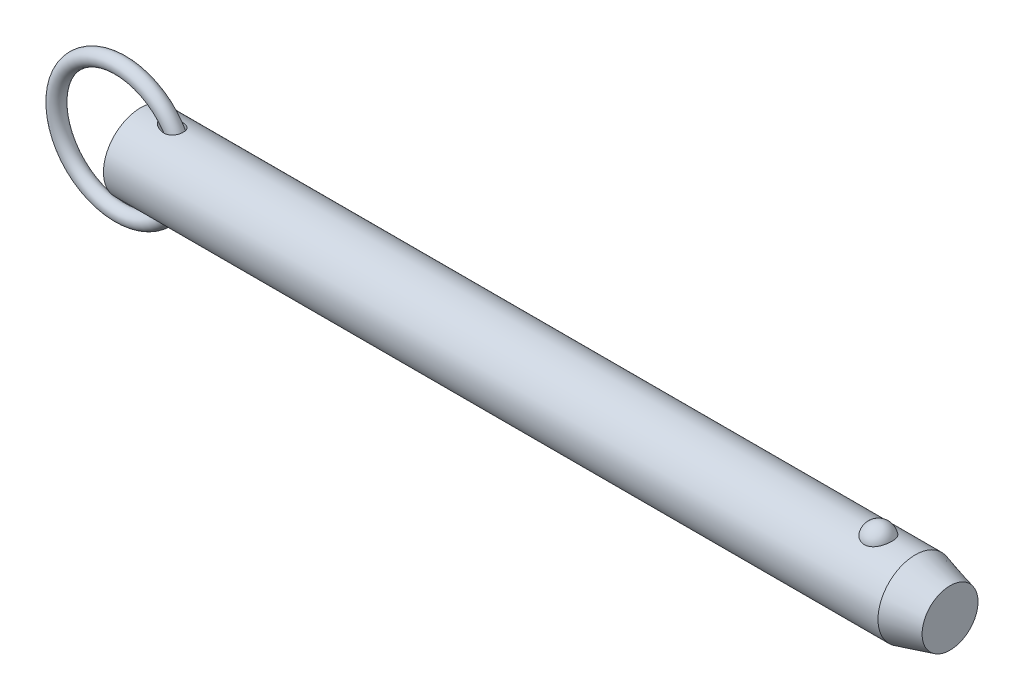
ISO-10303-21;
HEADER;
FILE_DESCRIPTION(('STEP AP214'),'2;1');
FILE_NAME('part.step','',(''),(''),'','','');
FILE_SCHEMA(('AUTOMOTIVE_DESIGN { 1 0 10303 214 1 1 1 1 }'));
ENDSEC;
DATA;
#1=APPLICATION_CONTEXT('core data for automotive mechanical design processes');
#2=APPLICATION_PROTOCOL_DEFINITION('international standard','automotive_design',2000,#1);
#3=PRODUCT_CONTEXT('',#1,'mechanical');
#4=PRODUCT('Part','Part','',(#3));
#5=PRODUCT_RELATED_PRODUCT_CATEGORY('part','',(#4));
#6=PRODUCT_DEFINITION_FORMATION('','',#4);
#7=PRODUCT_DEFINITION_CONTEXT('part definition',#1,'design');
#8=PRODUCT_DEFINITION('design','',#6,#7);
#9=PRODUCT_DEFINITION_SHAPE('','',#8);
#10=(LENGTH_UNIT() NAMED_UNIT(*) SI_UNIT(.MILLI.,.METRE.));
#11=(NAMED_UNIT(*) PLANE_ANGLE_UNIT() SI_UNIT($,.RADIAN.));
#12=(NAMED_UNIT(*) SI_UNIT($,.STERADIAN.) SOLID_ANGLE_UNIT());
#13=UNCERTAINTY_MEASURE_WITH_UNIT(LENGTH_MEASURE(1.E-05),#10,'distance_accuracy_value','');
#14=(GEOMETRIC_REPRESENTATION_CONTEXT(3) GLOBAL_UNCERTAINTY_ASSIGNED_CONTEXT((#13)) GLOBAL_UNIT_ASSIGNED_CONTEXT((#10,
#11,#12)) REPRESENTATION_CONTEXT('',''));
#15=CARTESIAN_POINT('',(0.,0.,0.));
#16=DIRECTION('',(0.,0.,1.));
#17=DIRECTION('',(1.,0.,0.));
#18=AXIS2_PLACEMENT_3D('',#15,#16,#17);
#19=CARTESIAN_POINT('',(-6.08699288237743,0.,0.));
#20=DIRECTION('',(0.,0.,1.));
#21=DIRECTION('',(1.,0.,0.));
#22=AXIS2_PLACEMENT_3D('',#19,#20,#21);
#23=TOROIDAL_SURFACE('',#22,19.05,2.223);
#24=CARTESIAN_POINT('',(15.1860071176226,0.,0.));
#25=VERTEX_POINT('',#24);
#26=VERTEX_LOOP('',#25);
#27=FACE_BOUND('',#26,.T.);
#28=ADVANCED_FACE('P0_F12',(#27),#23,.T.);
#29=CLOSED_SHELL('',(#28));
#30=MANIFOLD_SOLID_BREP('P0_B1',#29);
#31=CARTESIAN_POINT('',(0.,0.,0.));
#32=DIRECTION('',(1.,0.,0.));
#33=DIRECTION('',(0.,0.,-1.));
#34=AXIS2_PLACEMENT_3D('',#31,#32,#33);
#35=CYLINDRICAL_SURFACE('',#34,11.115);
#36=CARTESIAN_POINT('',(6.414051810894,11.0227946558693,-1.4287136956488));
#37=CARTESIAN_POINT('',(6.49338916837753,11.0115377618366,-1.51556642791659));
#38=CARTESIAN_POINT('',(6.57765461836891,10.9998263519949,-1.59789397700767));
#39=CARTESIAN_POINT('',(6.75386647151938,10.9760304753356,-1.75391400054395));
#40=CARTESIAN_POINT('',(6.84582247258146,10.9639455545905,-1.82759540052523));
#41=CARTESIAN_POINT('',(7.03627827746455,10.9397989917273,-1.96698954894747));
#42=CARTESIAN_POINT('',(7.13480838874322,10.9277377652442,-2.03266078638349));
#43=CARTESIAN_POINT('',(7.33681032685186,10.9041015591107,-2.1558582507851));
#44=CARTESIAN_POINT('',(7.44028007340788,10.8925263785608,-2.21338786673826));
#45=CARTESIAN_POINT('',(7.64386117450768,10.8710104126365,-2.31666528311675));
#46=CARTESIAN_POINT('',(7.74368989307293,10.8610119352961,-2.36295942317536));
#47=CARTESIAN_POINT('',(7.94637195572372,10.8420168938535,-2.44863486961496));
#48=CARTESIAN_POINT('',(8.04922612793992,10.8330206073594,-2.48801426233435));
#49=CARTESIAN_POINT('',(8.36115573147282,10.807980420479,-2.59542730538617));
#50=CARTESIAN_POINT('',(8.57411849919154,10.7938278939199,-2.65299817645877));
#51=CARTESIAN_POINT('',(9.00825016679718,10.7725818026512,-2.73800108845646));
#52=CARTESIAN_POINT('',(9.22947335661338,10.7655491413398,-2.76517330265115));
#53=CARTESIAN_POINT('',(9.67368141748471,10.7605872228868,-2.78445308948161));
#54=CARTESIAN_POINT('',(9.89666486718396,10.7626512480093,-2.77658653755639));
#55=CARTESIAN_POINT('',(10.2950172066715,10.7754452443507,-2.72644436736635));
#56=CARTESIAN_POINT('',(10.4712789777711,10.7844280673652,-2.69109376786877));
#57=CARTESIAN_POINT('',(10.7292776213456,10.8024982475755,-2.61722365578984));
#58=CARTESIAN_POINT('',(10.8142337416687,10.8092901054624,-2.58911576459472));
#59=CARTESIAN_POINT('',(10.9813218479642,10.8242580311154,-2.52581287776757));
#60=CARTESIAN_POINT('',(11.0634550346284,10.8324335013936,-2.49062094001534));
#61=CARTESIAN_POINT('',(11.2247418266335,10.8500287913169,-2.41281958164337));
#62=CARTESIAN_POINT('',(11.3038694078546,10.8594572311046,-2.37015806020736));
#63=CARTESIAN_POINT('',(11.4576781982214,10.8792243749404,-2.27770403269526));
#64=CARTESIAN_POINT('',(11.5323615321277,10.8895626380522,-2.22791497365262));
#65=CARTESIAN_POINT('',(11.6765388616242,10.9108113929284,-2.12140590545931));
#66=CARTESIAN_POINT('',(11.7460329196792,10.9217218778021,-2.06468597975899));
#67=CARTESIAN_POINT('',(11.8790597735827,10.9437207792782,-1.94471764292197));
#68=CARTESIAN_POINT('',(11.9425932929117,10.9548091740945,-1.88147002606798));
#69=CARTESIAN_POINT('',(12.109388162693,10.9851999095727,-1.69784918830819));
#70=CARTESIAN_POINT('',(12.205655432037,11.0042655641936,-1.57093023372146));
#71=CARTESIAN_POINT('',(12.374151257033,11.0393391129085,-1.3017676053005));
#72=CARTESIAN_POINT('',(12.4463875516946,11.0553479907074,-1.15952888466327));
#73=CARTESIAN_POINT('',(12.5615818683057,11.0816338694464,-0.87197217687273));
#74=CARTESIAN_POINT('',(12.6058896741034,11.0921698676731,-0.727217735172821));
#75=CARTESIAN_POINT('',(12.6699315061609,11.1075802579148,-0.432089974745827));
#76=CARTESIAN_POINT('',(12.6896681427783,11.1124552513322,-0.281717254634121));
#77=CARTESIAN_POINT('',(12.7040225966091,11.1159901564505,0.0188164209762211));
#78=CARTESIAN_POINT('',(12.6988836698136,11.1147102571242,0.168965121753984));
#79=CARTESIAN_POINT('',(12.6641681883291,11.1062126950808,0.466238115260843));
#80=CARTESIAN_POINT('',(12.6345920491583,11.0989951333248,0.613362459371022));
#81=CARTESIAN_POINT('',(12.5517453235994,11.0794095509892,0.900330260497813));
#82=CARTESIAN_POINT('',(12.4984878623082,11.0670443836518,1.0401777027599));
#83=CARTESIAN_POINT('',(12.3696588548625,11.0385082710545,1.308745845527));
#84=CARTESIAN_POINT('',(12.2940887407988,11.0223375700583,1.43746725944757));
#85=CARTESIAN_POINT('',(12.122380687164,10.987872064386,1.68079704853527));
#86=CARTESIAN_POINT('',(12.0261637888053,10.969569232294,1.79534850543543));
#87=CARTESIAN_POINT('',(11.8161707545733,10.932836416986,2.00695695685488));
#88=CARTESIAN_POINT('',(11.7023941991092,10.9144064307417,2.10401353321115));
#89=CARTESIAN_POINT('',(11.4575656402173,10.8788057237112,2.2810532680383));
#90=CARTESIAN_POINT('',(11.3261451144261,10.8616794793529,2.36053412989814));
#91=CARTESIAN_POINT('',(11.0523589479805,10.8308019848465,2.49839044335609));
#92=CARTESIAN_POINT('',(10.9099908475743,10.8170514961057,2.55676113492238));
#93=CARTESIAN_POINT('',(10.6060622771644,10.7929728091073,2.65666105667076));
#94=CARTESIAN_POINT('',(10.4438877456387,10.7830209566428,2.69640163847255));
#95=CARTESIAN_POINT('',(10.1154037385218,10.7687230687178,2.75293129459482));
#96=CARTESIAN_POINT('',(9.94909141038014,10.7643810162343,2.76970406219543));
#97=CARTESIAN_POINT('',(9.54387061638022,10.7604809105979,2.7848723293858));
#98=CARTESIAN_POINT('',(9.30446860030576,10.7637793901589,2.77227753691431));
#99=CARTESIAN_POINT('',(8.94961255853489,10.7757341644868,2.72524141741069));
#100=CARTESIAN_POINT('',(8.83186896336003,10.7808994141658,2.70482239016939));
#101=CARTESIAN_POINT('',(8.59835142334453,10.7932548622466,2.65509992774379));
#102=CARTESIAN_POINT('',(8.48257728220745,10.8004448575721,2.62579738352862));
#103=CARTESIAN_POINT('',(8.2520846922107,10.8166382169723,2.55827624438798));
#104=CARTESIAN_POINT('',(8.1374021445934,10.8256649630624,2.51994155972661));
#105=CARTESIAN_POINT('',(7.91132058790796,10.8451170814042,2.43486475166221));
#106=CARTESIAN_POINT('',(7.79992154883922,10.8555424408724,2.38812270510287));
#107=CARTESIAN_POINT('',(7.58115677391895,10.8774251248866,2.28638483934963));
#108=CARTESIAN_POINT('',(7.47378802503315,10.8888816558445,2.2313953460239));
#109=CARTESIAN_POINT('',(7.26385624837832,10.9124540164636,2.11310265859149));
#110=CARTESIAN_POINT('',(7.16129168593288,10.9245696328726,2.04980214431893));
#111=CARTESIAN_POINT('',(6.91882218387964,10.9543689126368,1.88540538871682));
#112=CARTESIAN_POINT('',(6.78193778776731,10.9721958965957,1.77979827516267));
#113=CARTESIAN_POINT('',(6.52472441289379,11.0070222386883,1.5498969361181));
#114=CARTESIAN_POINT('',(6.40436902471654,11.0240228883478,1.42563320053));
#115=CARTESIAN_POINT('',(6.21838804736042,11.0509658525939,1.19529359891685));
#116=CARTESIAN_POINT('',(6.14691885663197,11.0615430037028,1.09404520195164));
#117=CARTESIAN_POINT('',(6.02043496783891,11.0805004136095,0.881508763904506));
#118=CARTESIAN_POINT('',(5.96539400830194,11.0888841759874,0.770237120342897));
#119=CARTESIAN_POINT('',(5.88475453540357,11.1012553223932,0.560577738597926));
#120=CARTESIAN_POINT('',(5.85559643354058,11.1057686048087,0.463603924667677));
#121=CARTESIAN_POINT('',(5.81381299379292,11.1122523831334,0.26608330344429));
#122=CARTESIAN_POINT('',(5.80117118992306,11.1142254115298,0.165540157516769));
#123=CARTESIAN_POINT('',(5.79363815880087,11.1153999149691,-0.0364747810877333));
#124=CARTESIAN_POINT('',(5.79878799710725,11.1145949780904,-0.137948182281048));
#125=CARTESIAN_POINT('',(5.82639592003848,11.1102987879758,-0.338493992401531));
#126=CARTESIAN_POINT('',(5.84887234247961,11.1068046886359,-0.437563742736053));
#127=CARTESIAN_POINT('',(5.91510741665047,11.0965857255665,-0.649968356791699));
#128=CARTESIAN_POINT('',(5.9622090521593,11.0893566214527,-0.762222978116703));
#129=CARTESIAN_POINT('',(6.07378449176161,11.072471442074,-0.977396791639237));
#130=CARTESIAN_POINT('',(6.13826787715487,11.0628140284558,-1.08031079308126));
#131=CARTESIAN_POINT('',(6.24101077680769,11.0477136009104,-1.2219580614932));
#132=CARTESIAN_POINT('',(6.27403486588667,11.042895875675,-1.26469183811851));
#133=CARTESIAN_POINT('',(6.34238022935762,11.0330152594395,-1.34817011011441));
#134=CARTESIAN_POINT('',(6.37769867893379,11.0279526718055,-1.38891694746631));
#135=CARTESIAN_POINT('',(6.414051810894,11.0227946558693,-1.4287136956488));
#136=B_SPLINE_CURVE_WITH_KNOTS('',3,(#36,#37,#38,#39,#40,#41,#42,#43,#44,#45,#46,#47,#48,#49,
#50,#51,#52,#53,#54,#55,#56,#57,#58,#59,#60,#61,#62,#63,#64,#65,#66,#67,#68,#69,#70,#71,#72,#73,
#74,#75,#76,#77,#78,#79,#80,#81,#82,#83,#84,#85,#86,#87,#88,#89,#90,#91,#92,#93,#94,#95,#96,#97,
#98,#99,#100,#101,#102,#103,#104,#105,#106,#107,#108,#109,#110,#111,#112,#113,#114,#115,#116,
#117,#118,#119,#120,#121,#122,#123,#124,#125,#126,#127,#128,#129,#130,#131,#132,#133,#134,#135),
.UNSPECIFIED.,.T.,.F.,(4,2,2,2,2,2,2,2,2,2,2,2,2,2,2,2,2,2,2,2,2,2,2,2,2,2,2,2,2,2,2,2,2,2,2,2,
2,2,2,2,2,2,2,2,2,2,2,2,2,4),(0.,0.35443329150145,0.709315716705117,1.0659654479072,
1.42246628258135,1.7536715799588,2.08496839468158,2.74582009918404,3.41227815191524,
4.07824412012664,4.61583787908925,4.88478112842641,5.1536085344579,5.42439170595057,
5.69504436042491,5.96569375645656,6.23631025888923,6.71490729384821,7.19335005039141,
7.64641437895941,8.09943057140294,8.54802575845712,8.99661331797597,9.44495256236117,
9.89326303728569,10.3433195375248,10.7933867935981,11.2550086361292,11.7167345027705,
12.2165866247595,12.7167934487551,13.4318876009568,13.7904664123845,14.1490092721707,
14.5124394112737,14.8758662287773,15.239015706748,15.6020483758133,16.1219860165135,
16.6410830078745,17.0130520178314,17.3844231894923,17.6872330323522,17.9897407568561,
18.2929471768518,18.5964749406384,18.9603532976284,19.3244326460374,19.4870338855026,
19.649438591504),.UNSPECIFIED.);
#137=CARTESIAN_POINT('',(6.414051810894,11.0227946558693,-1.4287136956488));
#138=VERTEX_POINT('',#137);
#139=EDGE_CURVE('P1_E40',#138,#138,#136,.T.);
#140=ORIENTED_EDGE('',*,*,#139,.T.);
#141=EDGE_LOOP('',(#140));
#142=FACE_BOUND('',#141,.T.);
#143=CARTESIAN_POINT('',(230.929563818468,0.,0.));
#144=DIRECTION('',(1.,0.,0.));
#145=DIRECTION('',(0.,0.,-1.));
#146=AXIS2_PLACEMENT_3D('',#143,#144,#145);
#147=CIRCLE('',#146,11.115);
#148=CARTESIAN_POINT('',(230.929563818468,0.,-11.115));
#149=VERTEX_POINT('',#148);
#150=EDGE_CURVE('P1_E25',#149,#149,#147,.T.);
#151=ORIENTED_EDGE('',*,*,#150,.F.);
#152=EDGE_LOOP('',(#151));
#153=FACE_BOUND('',#152,.T.);
#154=CARTESIAN_POINT('',(0.,0.,0.));
#155=DIRECTION('',(1.,0.,0.));
#156=DIRECTION('',(0.,0.,-1.));
#157=AXIS2_PLACEMENT_3D('',#154,#155,#156);
#158=CIRCLE('',#157,11.115);
#159=CARTESIAN_POINT('',(0.,0.,-11.115));
#160=VERTEX_POINT('',#159);
#161=EDGE_CURVE('P1_E9',#160,#160,#158,.T.);
#162=ORIENTED_EDGE('',*,*,#161,.T.);
#163=EDGE_LOOP('',(#162));
#164=FACE_BOUND('',#163,.T.);
#165=CARTESIAN_POINT('',(219.931068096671,10.3028087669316,4.17077409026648));
#166=CARTESIAN_POINT('',(219.714775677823,10.3028003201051,4.17078240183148));
#167=CARTESIAN_POINT('',(219.498548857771,10.3098895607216,4.15340593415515));
#168=CARTESIAN_POINT('',(219.072540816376,10.3373834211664,4.08449540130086));
#169=CARTESIAN_POINT('',(218.862757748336,10.3577841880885,4.03297121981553));
#170=CARTESIAN_POINT('',(218.455782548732,10.4095237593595,3.89746513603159));
#171=CARTESIAN_POINT('',(218.258572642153,10.4408466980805,3.81353029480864));
#172=CARTESIAN_POINT('',(217.881338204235,10.5110236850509,3.61560339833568));
#173=CARTESIAN_POINT('',(217.701317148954,10.5498792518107,3.50160528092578));
#174=CARTESIAN_POINT('',(217.357684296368,10.6322884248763,3.24292464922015));
#175=CARTESIAN_POINT('',(217.194686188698,10.6759443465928,3.09746040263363));
#176=CARTESIAN_POINT('',(216.894591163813,10.7625291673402,2.78171925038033));
#177=CARTESIAN_POINT('',(216.757499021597,10.805457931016,2.61143778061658));
#178=CARTESIAN_POINT('',(216.506408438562,10.8881935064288,2.24226695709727));
#179=CARTESIAN_POINT('',(216.393710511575,10.9277761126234,2.0424412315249));
#180=CARTESIAN_POINT('',(216.201777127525,10.997484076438,1.62578254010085));
#181=CARTESIAN_POINT('',(216.122544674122,11.0276085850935,1.40894804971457));
#182=CARTESIAN_POINT('',(215.998303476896,11.0756732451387,0.961250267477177));
#183=CARTESIAN_POINT('',(215.953760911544,11.0934470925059,0.730239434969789));
#184=CARTESIAN_POINT('',(215.901569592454,11.1143331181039,0.26343964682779));
#185=CARTESIAN_POINT('',(215.893920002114,11.1174456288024,0.0276507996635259));
#186=CARTESIAN_POINT('',(215.91561056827,11.1087161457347,-0.44072963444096));
#187=CARTESIAN_POINT('',(215.944762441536,11.0969502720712,-0.673331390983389));
#188=CARTESIAN_POINT('',(216.039143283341,11.0597872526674,-1.12996621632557));
#189=CARTESIAN_POINT('',(216.104372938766,11.0343898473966,-1.3539991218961));
#190=CARTESIAN_POINT('',(216.26969844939,10.972515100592,-1.78750286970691));
#191=CARTESIAN_POINT('',(216.36983863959,10.9360236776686,-1.99695478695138));
#192=CARTESIAN_POINT('',(216.602940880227,10.8557595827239,-2.3952066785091));
#193=CARTESIAN_POINT('',(216.735905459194,10.8119863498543,-2.5840050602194));
#194=CARTESIAN_POINT('',(217.032407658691,10.7216733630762,-2.93635726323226));
#195=CARTESIAN_POINT('',(217.196056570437,10.675123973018,-3.09981510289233));
#196=CARTESIAN_POINT('',(217.549860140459,10.5846571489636,-3.39592247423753));
#197=CARTESIAN_POINT('',(217.740012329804,10.5407394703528,-3.52857487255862));
#198=CARTESIAN_POINT('',(218.13750141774,10.4616690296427,-3.75646057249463));
#199=CARTESIAN_POINT('',(218.34436705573,10.4263443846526,-3.85245432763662));
#200=CARTESIAN_POINT('',(218.772954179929,10.3675574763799,-4.00798747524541));
#201=CARTESIAN_POINT('',(218.994670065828,10.3440907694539,-4.06754052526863));
#202=CARTESIAN_POINT('',(219.434669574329,10.3128282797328,-4.1461431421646));
#203=CARTESIAN_POINT('',(219.652565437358,10.3043040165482,-4.16707833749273));
#204=CARTESIAN_POINT('',(220.08894951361,10.3016771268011,-4.17357158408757));
#205=CARTESIAN_POINT('',(220.307437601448,10.3075716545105,-4.15913661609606));
#206=CARTESIAN_POINT('',(220.731744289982,10.3326686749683,-4.09636961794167));
#207=CARTESIAN_POINT('',(220.937745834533,10.3514555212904,-4.04909574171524));
#208=CARTESIAN_POINT('',(221.338576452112,10.3998183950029,-3.92320197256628));
#209=CARTESIAN_POINT('',(221.5334046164,10.4293952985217,-3.84457953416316));
#210=CARTESIAN_POINT('',(221.911191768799,10.4969600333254,-3.65612410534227));
#211=CARTESIAN_POINT('',(222.093797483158,10.5351178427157,-3.54564545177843));
#212=CARTESIAN_POINT('',(222.438204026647,10.6154999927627,-3.29718036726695));
#213=CARTESIAN_POINT('',(222.600000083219,10.657725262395,-3.15918764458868));
#214=CARTESIAN_POINT('',(222.906959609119,10.744212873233,-2.8516358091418));
#215=CARTESIAN_POINT('',(223.050891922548,10.7884718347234,-2.68084605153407));
#216=CARTESIAN_POINT('',(223.309237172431,10.872374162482,-2.31721864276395));
#217=CARTESIAN_POINT('',(223.423644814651,10.9120167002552,-2.12437704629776));
#218=CARTESIAN_POINT('',(223.623873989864,10.9838919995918,-1.71516999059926));
#219=CARTESIAN_POINT('',(223.70866178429,11.0158465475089,-1.49824866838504));
#220=CARTESIAN_POINT('',(223.84268382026,11.0673523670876,-1.05228572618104));
#221=CARTESIAN_POINT('',(223.891917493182,11.086903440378,-0.823243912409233));
#222=CARTESIAN_POINT('',(223.953891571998,11.1116323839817,-0.359087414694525));
#223=CARTESIAN_POINT('',(223.966566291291,11.1167843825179,-0.123962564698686));
#224=CARTESIAN_POINT('',(223.954973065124,11.1121144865,0.345220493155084));
#225=CARTESIAN_POINT('',(223.930705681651,11.1022928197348,0.579278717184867));
#226=CARTESIAN_POINT('',(223.845907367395,11.0687504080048,1.03866534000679));
#227=CARTESIAN_POINT('',(223.785529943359,11.0450885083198,1.26402641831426));
#228=CARTESIAN_POINT('',(223.629853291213,10.9863185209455,1.70076772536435));
#229=CARTESIAN_POINT('',(223.534551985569,10.9512097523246,1.91214712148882));
#230=CARTESIAN_POINT('',(223.310397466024,10.8729733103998,2.31608359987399));
#231=CARTESIAN_POINT('',(223.181380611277,10.8298068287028,2.50854240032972));
#232=CARTESIAN_POINT('',(222.892732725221,10.7401896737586,2.86808766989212));
#233=CARTESIAN_POINT('',(222.733102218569,10.6937390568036,3.03517457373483));
#234=CARTESIAN_POINT('',(222.387534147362,10.6029321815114,3.33857581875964));
#235=CARTESIAN_POINT('',(222.201708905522,10.5585680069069,3.47501541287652));
#236=CARTESIAN_POINT('',(221.807875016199,10.4769321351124,3.71390897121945));
#237=CARTESIAN_POINT('',(221.599863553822,10.439661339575,3.81635861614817));
#238=CARTESIAN_POINT('',(221.154066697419,10.3749407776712,3.9891063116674));
#239=CARTESIAN_POINT('',(220.915234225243,10.3482457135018,4.0570092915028));
#240=CARTESIAN_POINT('',(220.427925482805,10.312188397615,4.14782844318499));
#241=CARTESIAN_POINT('',(220.179453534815,10.3028184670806,4.17076454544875));
#242=CARTESIAN_POINT('',(219.931068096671,10.3028087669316,4.17077409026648));
#243=B_SPLINE_CURVE_WITH_KNOTS('',3,(#165,#166,#167,#168,#169,#170,#171,#172,#173,#174,#175,
#176,#177,#178,#179,#180,#181,#182,#183,#184,#185,#186,#187,#188,#189,#190,#191,#192,#193,#194,
#195,#196,#197,#198,#199,#200,#201,#202,#203,#204,#205,#206,#207,#208,#209,#210,#211,#212,#213,
#214,#215,#216,#217,#218,#219,#220,#221,#222,#223,#224,#225,#226,#227,#228,#229,#230,#231,#232,
#233,#234,#235,#236,#237,#238,#239,#240,#241,#242),.UNSPECIFIED.,.T.,.F.,(4,2,2,2,2,2,2,2,2,2,2,
2,2,2,2,2,2,2,2,2,2,2,2,2,2,2,2,2,2,2,2,2,2,2,2,2,2,2,4),(0.,0.64796614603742,1.29574482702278,
1.94258643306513,2.58955857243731,3.25496465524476,3.92049326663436,4.61566368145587,
5.3108964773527,6.01531821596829,6.71972398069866,7.42054043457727,8.12137023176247,
8.82309331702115,9.52487047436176,10.2292439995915,10.9335519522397,11.6223330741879,
12.3108558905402,12.9647664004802,13.6185478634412,14.2521847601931,14.8858731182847,
15.5334360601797,16.1811472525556,16.8611459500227,17.5412664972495,18.2431855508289,
18.9451158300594,19.6483065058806,20.3514864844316,21.0516982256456,21.7519516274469,
22.4556690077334,23.1593743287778,23.8601491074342,24.5610129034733,25.3054529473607,
26.0495629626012),.UNSPECIFIED.);
#244=CARTESIAN_POINT('',(219.931068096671,10.3028087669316,4.17077409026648));
#245=VERTEX_POINT('',#244);
#246=EDGE_CURVE('P1_E34',#245,#245,#243,.T.);
#247=ORIENTED_EDGE('',*,*,#246,.T.);
#248=EDGE_LOOP('',(#247));
#249=FACE_BOUND('',#248,.T.);
#250=CARTESIAN_POINT('',(6.414051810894,-11.0227946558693,-1.4287136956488));
#251=CARTESIAN_POINT('',(6.33124061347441,-11.0345445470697,-1.33806125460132));
#252=CARTESIAN_POINT('',(6.25372866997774,-11.0458090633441,-1.24240732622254));
#253=CARTESIAN_POINT('',(6.11277905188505,-11.0666115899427,-1.04095704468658));
#254=CARTESIAN_POINT('',(6.04933920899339,-11.0761498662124,-0.935162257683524));
#255=CARTESIAN_POINT('',(5.94029181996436,-11.0927063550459,-0.712476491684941));
#256=CARTESIAN_POINT('',(5.89492964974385,-11.0996897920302,-0.595457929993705));
#257=CARTESIAN_POINT('',(5.8449816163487,-11.1074141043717,-0.414997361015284));
#258=CARTESIAN_POINT('',(5.83135004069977,-11.1095300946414,-0.354047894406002));
#259=CARTESIAN_POINT('',(5.81051649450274,-11.1127688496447,-0.231041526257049));
#260=CARTESIAN_POINT('',(5.80331311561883,-11.1138918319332,-0.1689848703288));
#261=CARTESIAN_POINT('',(5.79296529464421,-11.1155042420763,-0.000484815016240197));
#262=CARTESIAN_POINT('',(5.79625267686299,-11.1149904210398,0.106437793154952));
#263=CARTESIAN_POINT('',(5.82213676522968,-11.1109609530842,0.317809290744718));
#264=CARTESIAN_POINT('',(5.84474662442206,-11.1074432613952,0.422256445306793));
#265=CARTESIAN_POINT('',(5.91113114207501,-11.097197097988,0.639361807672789));
#266=CARTESIAN_POINT('',(5.95733120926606,-11.090102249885,0.751250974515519));
#267=CARTESIAN_POINT('',(6.06709542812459,-11.0734770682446,0.965912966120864));
#268=CARTESIAN_POINT('',(6.13068735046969,-11.06394284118,1.06867085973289));
#269=CARTESIAN_POINT('',(6.30294237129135,-11.0385920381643,1.30890635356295));
#270=CARTESIAN_POINT('',(6.4189620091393,-11.0218881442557,1.44097376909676));
#271=CARTESIAN_POINT('',(6.66989654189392,-10.9871512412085,1.68553954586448));
#272=CARTESIAN_POINT('',(6.80485520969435,-10.9691152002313,1.79799117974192));
#273=CARTESIAN_POINT('',(7.04881236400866,-10.9382283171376,1.97587596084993));
#274=CARTESIAN_POINT('',(7.15465712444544,-10.9253240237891,2.04570822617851));
#275=CARTESIAN_POINT('',(7.37202504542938,-10.9000987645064,2.17611840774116));
#276=CARTESIAN_POINT('',(7.48355057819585,-10.8877780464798,2.23669241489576));
#277=CARTESIAN_POINT('',(7.71132418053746,-10.8641580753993,2.34873831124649));
#278=CARTESIAN_POINT('',(7.82757727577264,-10.8528599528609,2.40020018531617));
#279=CARTESIAN_POINT('',(8.06386825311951,-10.8317234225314,2.49385169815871));
#280=CARTESIAN_POINT('',(8.18390558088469,-10.8218848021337,2.53604268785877));
#281=CARTESIAN_POINT('',(8.42918336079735,-10.8039208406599,2.61152283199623));
#282=CARTESIAN_POINT('',(8.55447802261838,-10.7958283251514,2.64464414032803));
#283=CARTESIAN_POINT('',(8.80752127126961,-10.781995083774,2.70048793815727));
#284=CARTESIAN_POINT('',(8.93527019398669,-10.7762546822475,2.72320899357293));
#285=CARTESIAN_POINT('',(9.19210176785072,-10.7675291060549,2.75750994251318));
#286=CARTESIAN_POINT('',(9.32118105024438,-10.7645381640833,2.76911315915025));
#287=CARTESIAN_POINT('',(9.57984338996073,-10.761622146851,2.78042035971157));
#288=CARTESIAN_POINT('',(9.70942621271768,-10.7616957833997,2.78012934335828));
#289=CARTESIAN_POINT('',(10.0243125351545,-10.7659059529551,2.76381534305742));
#290=CARTESIAN_POINT('',(10.209307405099,-10.7717977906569,2.74099674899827));
#291=CARTESIAN_POINT('',(10.5731188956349,-10.7905408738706,2.66626238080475));
#292=CARTESIAN_POINT('',(10.7519389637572,-10.8033881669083,2.61436313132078));
#293=CARTESIAN_POINT('',(11.0114289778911,-10.8271584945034,2.51336808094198));
#294=CARTESIAN_POINT('',(11.0968318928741,-10.835881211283,2.47562331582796));
#295=CARTESIAN_POINT('',(11.2636000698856,-10.8545688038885,2.39236170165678));
#296=CARTESIAN_POINT('',(11.344967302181,-10.8645330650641,2.34684869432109));
#297=CARTESIAN_POINT('',(11.5027832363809,-10.8853818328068,2.24815967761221));
#298=CARTESIAN_POINT('',(11.5792327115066,-10.8962661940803,2.19498487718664));
#299=CARTESIAN_POINT('',(11.7263315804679,-10.9185541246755,2.08128855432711));
#300=CARTESIAN_POINT('',(11.7969818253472,-10.9299576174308,2.02076811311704));
#301=CARTESIAN_POINT('',(11.9817953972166,-10.9613645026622,1.84513663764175));
#302=CARTESIAN_POINT('',(12.0893012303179,-10.9814643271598,1.72286660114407));
#303=CARTESIAN_POINT('',(12.2803576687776,-11.0193991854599,1.46066991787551));
#304=CARTESIAN_POINT('',(12.3639173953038,-11.0372350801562,1.32075002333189));
#305=CARTESIAN_POINT('',(12.4996220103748,-11.0672969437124,1.03778067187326));
#306=CARTESIAN_POINT('',(12.5535315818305,-11.0798242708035,0.895607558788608));
#307=CARTESIAN_POINT('',(12.636874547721,-11.0995427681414,0.603918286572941));
#308=CARTESIAN_POINT('',(12.6663115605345,-11.1067347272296,0.454403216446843));
#309=CARTESIAN_POINT('',(12.6997387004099,-11.1149224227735,0.154577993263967));
#310=CARTESIAN_POINT('',(12.7040886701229,-11.1160057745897,0.00431019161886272));
#311=CARTESIAN_POINT('',(12.6882048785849,-11.1120956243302,-0.294841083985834));
#312=CARTESIAN_POINT('',(12.6679715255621,-11.1071022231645,-0.443724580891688));
#313=CARTESIAN_POINT('',(12.6034470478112,-11.0915888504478,-0.735688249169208));
#314=CARTESIAN_POINT('',(12.5591858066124,-11.0810757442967,-0.878775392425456));
#315=CARTESIAN_POINT('',(12.4477416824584,-11.0556687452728,-1.1552952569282));
#316=CARTESIAN_POINT('',(12.3805601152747,-11.0407751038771,-1.28872853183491));
#317=CARTESIAN_POINT('',(12.2248919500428,-11.0081839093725,-1.54257976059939));
#318=CARTESIAN_POINT('',(12.1363549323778,-10.9904797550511,-1.66296592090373));
#319=CARTESIAN_POINT('',(11.9406137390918,-10.9541951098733,-1.88726577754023));
#320=CARTESIAN_POINT('',(11.833409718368,-10.9356146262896,-1.99117961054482));
#321=CARTESIAN_POINT('',(11.601318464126,-10.8991360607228,-2.18213646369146));
#322=CARTESIAN_POINT('',(11.4761325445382,-10.8812577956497,-2.26881927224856));
#323=CARTESIAN_POINT('',(11.2134852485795,-10.8482871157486,-2.42157282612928));
#324=CARTESIAN_POINT('',(11.0760218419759,-10.8331951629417,-2.48764015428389));
#325=CARTESIAN_POINT('',(10.7828968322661,-10.8061050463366,-2.60290068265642));
#326=CARTESIAN_POINT('',(10.6266338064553,-10.7943907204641,-2.65062248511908));
#327=CARTESIAN_POINT('',(10.3086617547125,-10.7762429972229,-2.72345054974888));
#328=CARTESIAN_POINT('',(10.146948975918,-10.7698133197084,-2.74854088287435));
#329=CARTESIAN_POINT('',(9.75541304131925,-10.7608036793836,-2.78368719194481));
#330=CARTESIAN_POINT('',(9.52459435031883,-10.7608467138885,-2.78350276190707));
#331=CARTESIAN_POINT('',(9.0660496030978,-10.7702674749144,-2.74677945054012));
#332=CARTESIAN_POINT('',(8.83832966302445,-10.7796615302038,-2.71017697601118));
#333=CARTESIAN_POINT('',(8.38783466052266,-10.8058248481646,-2.60392490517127));
#334=CARTESIAN_POINT('',(8.16517101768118,-10.8226939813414,-2.53382676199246));
#335=CARTESIAN_POINT('',(7.84087311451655,-10.8516548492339,-2.40555545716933));
#336=CARTESIAN_POINT('',(7.73435551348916,-10.8619221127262,-2.35892455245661));
#337=CARTESIAN_POINT('',(7.52510420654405,-10.883357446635,-2.25797017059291));
#338=CARTESIAN_POINT('',(7.42236986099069,-10.8945253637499,-2.20364800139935));
#339=CARTESIAN_POINT('',(7.23808758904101,-10.915528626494,-2.09688018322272));
#340=CARTESIAN_POINT('',(7.15584631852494,-10.9252787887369,-2.04561072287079));
#341=CARTESIAN_POINT('',(6.99510576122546,-10.944960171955,-1.93754729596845));
#342=CARTESIAN_POINT('',(6.91660574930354,-10.9548913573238,-1.88075440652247));
#343=CARTESIAN_POINT('',(6.76418133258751,-10.974690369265,-1.7615450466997));
#344=CARTESIAN_POINT('',(6.69024940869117,-10.984558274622,-1.69913825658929));
#345=CARTESIAN_POINT('',(6.54780119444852,-11.0039826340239,-1.56842485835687));
#346=CARTESIAN_POINT('',(6.47928247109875,-11.0135392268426,-1.50012092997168));
#347=CARTESIAN_POINT('',(6.414051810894,-11.0227946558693,-1.4287136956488));
#348=B_SPLINE_CURVE_WITH_KNOTS('',3,(#250,#251,#252,#253,#254,#255,#256,#257,#258,#259,#260,
#261,#262,#263,#264,#265,#266,#267,#268,#269,#270,#271,#272,#273,#274,#275,#276,#277,#278,#279,
#280,#281,#282,#283,#284,#285,#286,#287,#288,#289,#290,#291,#292,#293,#294,#295,#296,#297,#298,
#299,#300,#301,#302,#303,#304,#305,#306,#307,#308,#309,#310,#311,#312,#313,#314,#315,#316,#317,
#318,#319,#320,#321,#322,#323,#324,#325,#326,#327,#328,#329,#330,#331,#332,#333,#334,#335,#336,
#337,#338,#339,#340,#341,#342,#343,#344,#345,#346,#347),.UNSPECIFIED.,.T.,.F.,(4,2,2,2,2,2,2,2,
2,2,2,2,2,2,2,2,2,2,2,2,2,2,2,2,2,2,2,2,2,2,2,2,2,2,2,2,2,2,2,2,2,2,2,2,2,2,2,2,4),(0.,
0.36983565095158,0.739614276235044,1.1142538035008,1.30141910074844,1.48854338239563,
1.8074587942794,2.12659146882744,2.4883888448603,2.85076733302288,3.3776216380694,
3.90571433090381,4.287639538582,4.66972556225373,5.05222896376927,5.43467659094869,
5.82378546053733,6.21294796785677,6.6012922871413,6.98947336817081,7.54669558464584,
8.10360148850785,8.3845853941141,8.66543074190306,8.94623182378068,9.22699162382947,
9.71628887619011,10.2053995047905,10.6608871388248,11.1163074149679,11.5651786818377,
12.0140424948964,12.4623493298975,12.9106304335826,13.3599804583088,13.8093267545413,
14.2672570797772,14.7252632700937,15.214740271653,15.7045615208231,16.3932594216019,
17.083162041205,17.7825738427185,18.1325177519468,18.4824022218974,18.7744056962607,
19.0663523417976,19.3578048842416,19.6491256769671),.UNSPECIFIED.);
#349=CARTESIAN_POINT('',(6.414051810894,-11.0227946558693,-1.4287136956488));
#350=VERTEX_POINT('',#349);
#351=EDGE_CURVE('P1_E17',#350,#350,#348,.T.);
#352=ORIENTED_EDGE('',*,*,#351,.T.);
#353=EDGE_LOOP('',(#352));
#354=FACE_BOUND('',#353,.T.);
#355=ADVANCED_FACE('P1_F13',(#142,#153,#164,#249,#354),#35,.T.);
#356=CARTESIAN_POINT('',(0.,0.,0.));
#357=DIRECTION('',(-1.,0.,0.));
#358=DIRECTION('',(0.,0.,1.));
#359=AXIS2_PLACEMENT_3D('',#356,#357,#358);
#360=PLANE('',#359);
#361=ORIENTED_EDGE('',*,*,#161,.F.);
#362=EDGE_LOOP('',(#361));
#363=FACE_BOUND('',#362,.T.);
#364=ADVANCED_FACE('P1_F15',(#363),#360,.T.);
#365=CARTESIAN_POINT('',(241.3,0.,0.));
#366=DIRECTION('',(-1.,0.,0.));
#367=DIRECTION('',(0.,0.,1.));
#368=AXIS2_PLACEMENT_3D('',#365,#366,#367);
#369=CONICAL_SURFACE('',#368,8.33625000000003,0.261799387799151);
#370=ORIENTED_EDGE('',*,*,#150,.T.);
#371=EDGE_LOOP('',(#370));
#372=FACE_BOUND('',#371,.T.);
#373=CARTESIAN_POINT('',(241.3,0.,0.));
#374=DIRECTION('',(1.,0.,0.));
#375=DIRECTION('',(0.,0.,-1.));
#376=AXIS2_PLACEMENT_3D('',#373,#374,#375);
#377=CIRCLE('',#376,8.33625000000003);
#378=CARTESIAN_POINT('',(241.3,0.,-8.33625000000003));
#379=VERTEX_POINT('',#378);
#380=EDGE_CURVE('P1_E30',#379,#379,#377,.T.);
#381=ORIENTED_EDGE('',*,*,#380,.F.);
#382=EDGE_LOOP('',(#381));
#383=FACE_BOUND('',#382,.T.);
#384=ADVANCED_FACE('P1_F55',(#372,#383),#369,.T.);
#385=CARTESIAN_POINT('',(241.3,8.33625000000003,0.));
#386=DIRECTION('',(1.,0.,0.));
#387=DIRECTION('',(0.,0.,-1.));
#388=AXIS2_PLACEMENT_3D('',#385,#386,#387);
#389=PLANE('',#388);
#390=ORIENTED_EDGE('',*,*,#380,.T.);
#391=EDGE_LOOP('',(#390));
#392=FACE_BOUND('',#391,.T.);
#393=ADVANCED_FACE('P1_F51',(#392),#389,.T.);
#394=CARTESIAN_POINT('',(219.931068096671,10.0035,0.));
#395=DIRECTION('',(-1.,0.,0.));
#396=DIRECTION('',(0.,1.,0.));
#397=AXIS2_PLACEMENT_3D('',#394,#395,#396);
#398=SPHERICAL_SURFACE('',#397,4.18150000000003);
#399=ORIENTED_EDGE('',*,*,#246,.F.);
#400=EDGE_LOOP('',(#399));
#401=FACE_BOUND('',#400,.T.);
#402=ADVANCED_FACE('P1_F46',(#401),#398,.T.);
#403=CARTESIAN_POINT('',(-6.08699288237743,0.,0.));
#404=DIRECTION('',(0.,0.,1.));
#405=DIRECTION('',(1.,0.,0.));
#406=AXIS2_PLACEMENT_3D('',#403,#404,#405);
#407=TOROIDAL_SURFACE('',#406,19.05,2.77875);
#408=ORIENTED_EDGE('',*,*,#351,.F.);
#409=EDGE_LOOP('',(#408));
#410=FACE_BOUND('',#409,.T.);
#411=ORIENTED_EDGE('',*,*,#139,.F.);
#412=EDGE_LOOP('',(#411));
#413=FACE_BOUND('',#412,.T.);
#414=ADVANCED_FACE('P1_F50',(#410,#413),#407,.F.);
#415=CLOSED_SHELL('',(#355,#364,#384,#393,#402,#414));
#416=MANIFOLD_SOLID_BREP('P1_B1',#415);
#417=ADVANCED_BREP_SHAPE_REPRESENTATION('',(#18,#30,#416),#14);
#418=SHAPE_DEFINITION_REPRESENTATION(#9,#417);
ENDSEC;
END-ISO-10303-21;
